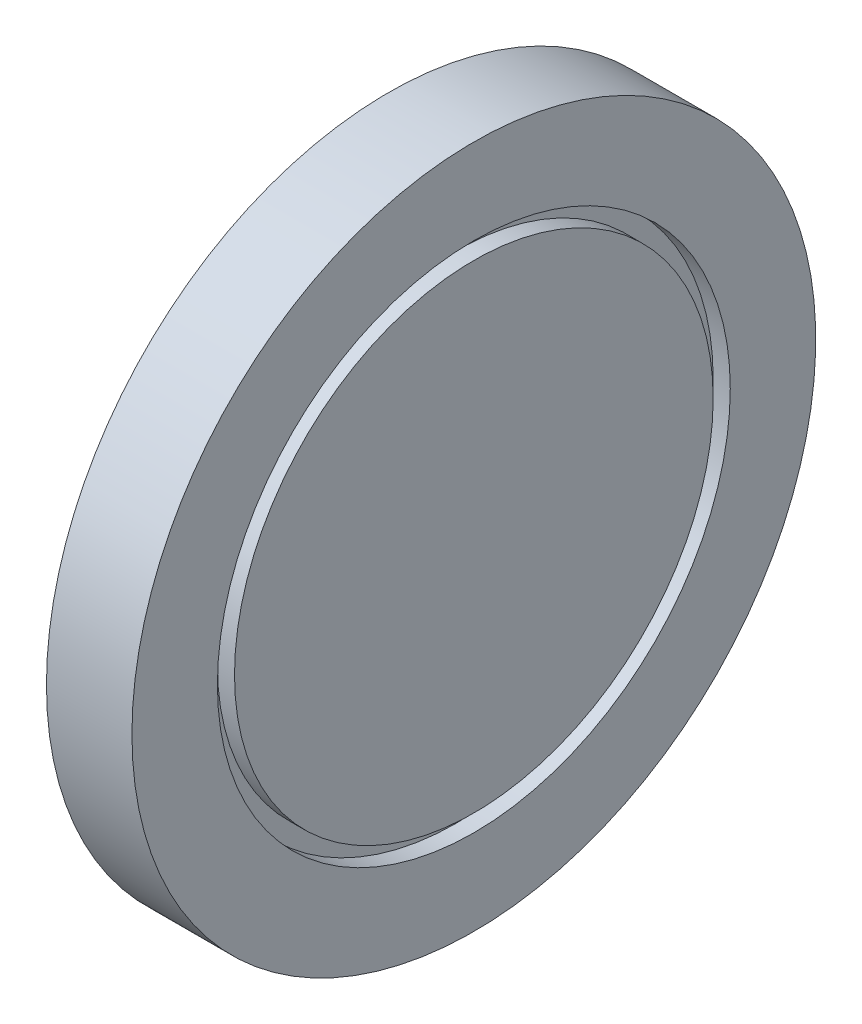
ISO-10303-21;
HEADER;
FILE_DESCRIPTION(('STEP AP214'),'2;1');
FILE_NAME('part.step','',(''),(''),'','','');
FILE_SCHEMA(('AUTOMOTIVE_DESIGN { 1 0 10303 214 1 1 1 1 }'));
ENDSEC;
DATA;
#1=APPLICATION_CONTEXT('core data for automotive mechanical design processes');
#2=APPLICATION_PROTOCOL_DEFINITION('international standard','automotive_design',2000,#1);
#3=PRODUCT_CONTEXT('',#1,'mechanical');
#4=PRODUCT('Part','Part','',(#3));
#5=PRODUCT_RELATED_PRODUCT_CATEGORY('part','',(#4));
#6=PRODUCT_DEFINITION_FORMATION('','',#4);
#7=PRODUCT_DEFINITION_CONTEXT('part definition',#1,'design');
#8=PRODUCT_DEFINITION('design','',#6,#7);
#9=PRODUCT_DEFINITION_SHAPE('','',#8);
#10=(LENGTH_UNIT() NAMED_UNIT(*) SI_UNIT(.MILLI.,.METRE.));
#11=(NAMED_UNIT(*) PLANE_ANGLE_UNIT() SI_UNIT($,.RADIAN.));
#12=(NAMED_UNIT(*) SI_UNIT($,.STERADIAN.) SOLID_ANGLE_UNIT());
#13=UNCERTAINTY_MEASURE_WITH_UNIT(LENGTH_MEASURE(1.E-05),#10,'distance_accuracy_value','');
#14=(GEOMETRIC_REPRESENTATION_CONTEXT(3) GLOBAL_UNCERTAINTY_ASSIGNED_CONTEXT((#13)) GLOBAL_UNIT_ASSIGNED_CONTEXT((#10,
#11,#12)) REPRESENTATION_CONTEXT('',''));
#15=CARTESIAN_POINT('',(0.,0.,0.));
#16=DIRECTION('',(0.,0.,1.));
#17=DIRECTION('',(1.,0.,0.));
#18=AXIS2_PLACEMENT_3D('',#15,#16,#17);
#19=CARTESIAN_POINT('',(0.,0.,0.));
#20=DIRECTION('',(1.,0.,0.));
#21=DIRECTION('',(0.,0.,-1.));
#22=AXIS2_PLACEMENT_3D('',#19,#20,#21);
#23=PLANE('',#22);
#24=CARTESIAN_POINT('',(0.,0.,0.));
#25=DIRECTION('',(-1.,0.,0.));
#26=DIRECTION('',(0.,0.,1.));
#27=AXIS2_PLACEMENT_3D('',#24,#25,#26);
#28=CIRCLE('',#27,100.);
#29=CARTESIAN_POINT('',(0.,0.,100.));
#30=VERTEX_POINT('',#29);
#31=EDGE_CURVE('E44',#30,#30,#28,.T.);
#32=ORIENTED_EDGE('',*,*,#31,.T.);
#33=EDGE_LOOP('',(#32));
#34=FACE_BOUND('',#33,.T.);
#35=CARTESIAN_POINT('',(0.,0.,0.));
#36=DIRECTION('',(1.,0.,0.));
#37=DIRECTION('',(0.,0.,-1.));
#38=AXIS2_PLACEMENT_3D('',#35,#36,#37);
#39=CIRCLE('',#38,3.5);
#40=CARTESIAN_POINT('',(0.,0.,-3.5));
#41=VERTEX_POINT('',#40);
#42=EDGE_CURVE('E10',#41,#41,#39,.F.);
#43=ORIENTED_EDGE('',*,*,#42,.F.);
#44=EDGE_LOOP('',(#43));
#45=FACE_BOUND('',#44,.T.);
#46=ADVANCED_FACE('F32',(#34,#45),#23,.F.);
#47=CARTESIAN_POINT('',(-63.8520449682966,0.,0.));
#48=DIRECTION('',(-1.,0.,0.));
#49=DIRECTION('',(0.,0.,1.));
#50=AXIS2_PLACEMENT_3D('',#47,#48,#49);
#51=CYLINDRICAL_SURFACE('',#50,100.);
#52=ORIENTED_EDGE('',*,*,#31,.F.);
#53=EDGE_LOOP('',(#52));
#54=FACE_BOUND('',#53,.T.);
#55=CARTESIAN_POINT('',(25.,0.,0.));
#56=DIRECTION('',(-1.,0.,0.));
#57=DIRECTION('',(0.,0.,1.));
#58=AXIS2_PLACEMENT_3D('',#55,#56,#57);
#59=CIRCLE('',#58,100.);
#60=CARTESIAN_POINT('',(25.,0.,100.));
#61=VERTEX_POINT('',#60);
#62=EDGE_CURVE('E49',#61,#61,#59,.T.);
#63=ORIENTED_EDGE('',*,*,#62,.T.);
#64=EDGE_LOOP('',(#63));
#65=FACE_BOUND('',#64,.T.);
#66=ADVANCED_FACE('F76',(#54,#65),#51,.T.);
#67=CARTESIAN_POINT('',(25.,0.,0.));
#68=DIRECTION('',(-1.,0.,0.));
#69=DIRECTION('',(0.,0.,1.));
#70=AXIS2_PLACEMENT_3D('',#67,#68,#69);
#71=PLANE('',#70);
#72=CARTESIAN_POINT('',(25.,0.,0.));
#73=DIRECTION('',(1.,0.,0.));
#74=DIRECTION('',(0.,0.,-1.));
#75=AXIS2_PLACEMENT_3D('',#72,#73,#74);
#76=CIRCLE('',#75,75.);
#77=CARTESIAN_POINT('',(25.,0.,-75.));
#78=VERTEX_POINT('',#77);
#79=EDGE_CURVE('E91',#78,#78,#76,.T.);
#80=ORIENTED_EDGE('',*,*,#79,.F.);
#81=EDGE_LOOP('',(#80));
#82=FACE_BOUND('',#81,.T.);
#83=ORIENTED_EDGE('',*,*,#62,.F.);
#84=EDGE_LOOP('',(#83));
#85=FACE_BOUND('',#84,.T.);
#86=ADVANCED_FACE('F81',(#82,#85),#71,.F.);
#87=CARTESIAN_POINT('',(20.,0.,0.));
#88=DIRECTION('',(1.,0.,0.));
#89=DIRECTION('',(0.,0.,-1.));
#90=AXIS2_PLACEMENT_3D('',#87,#88,#89);
#91=CYLINDRICAL_SURFACE('',#90,75.);
#92=CARTESIAN_POINT('',(20.,0.,0.));
#93=DIRECTION('',(1.,0.,0.));
#94=DIRECTION('',(0.,0.,-1.));
#95=AXIS2_PLACEMENT_3D('',#92,#93,#94);
#96=CIRCLE('',#95,75.);
#97=CARTESIAN_POINT('',(20.,0.,-75.));
#98=VERTEX_POINT('',#97);
#99=EDGE_CURVE('E89',#98,#98,#96,.T.);
#100=ORIENTED_EDGE('',*,*,#99,.F.);
#101=EDGE_LOOP('',(#100));
#102=FACE_BOUND('',#101,.T.);
#103=ORIENTED_EDGE('',*,*,#79,.T.);
#104=EDGE_LOOP('',(#103));
#105=FACE_BOUND('',#104,.T.);
#106=ADVANCED_FACE('F118',(#102,#105),#91,.F.);
#107=CARTESIAN_POINT('',(20.,0.,0.));
#108=DIRECTION('',(1.,0.,0.));
#109=DIRECTION('',(0.,0.,-1.));
#110=AXIS2_PLACEMENT_3D('',#107,#108,#109);
#111=PLANE('',#110);
#112=CARTESIAN_POINT('',(20.,0.,0.));
#113=DIRECTION('',(1.,0.,0.));
#114=DIRECTION('',(0.,0.,-1.));
#115=AXIS2_PLACEMENT_3D('',#112,#113,#114);
#116=CIRCLE('',#115,70.);
#117=CARTESIAN_POINT('',(20.,0.,-70.));
#118=VERTEX_POINT('',#117);
#119=EDGE_CURVE('E95',#118,#118,#116,.T.);
#120=ORIENTED_EDGE('',*,*,#119,.F.);
#121=EDGE_LOOP('',(#120));
#122=FACE_BOUND('',#121,.T.);
#123=ORIENTED_EDGE('',*,*,#99,.T.);
#124=EDGE_LOOP('',(#123));
#125=FACE_BOUND('',#124,.T.);
#126=ADVANCED_FACE('F115',(#122,#125),#111,.T.);
#127=CARTESIAN_POINT('',(20.,0.,0.));
#128=DIRECTION('',(1.,0.,0.));
#129=DIRECTION('',(0.,0.,-1.));
#130=AXIS2_PLACEMENT_3D('',#127,#128,#129);
#131=CYLINDRICAL_SURFACE('',#130,70.);
#132=ORIENTED_EDGE('',*,*,#119,.T.);
#133=EDGE_LOOP('',(#132));
#134=FACE_BOUND('',#133,.T.);
#135=CARTESIAN_POINT('',(25.,0.,0.));
#136=DIRECTION('',(1.,0.,0.));
#137=DIRECTION('',(0.,0.,-1.));
#138=AXIS2_PLACEMENT_3D('',#135,#136,#137);
#139=CIRCLE('',#138,70.);
#140=CARTESIAN_POINT('',(25.,0.,-70.));
#141=VERTEX_POINT('',#140);
#142=EDGE_CURVE('E97',#141,#141,#139,.T.);
#143=ORIENTED_EDGE('',*,*,#142,.F.);
#144=EDGE_LOOP('',(#143));
#145=FACE_BOUND('',#144,.T.);
#146=ADVANCED_FACE('F112',(#134,#145),#131,.T.);
#147=ORIENTED_EDGE('',*,*,#142,.T.);
#148=EDGE_LOOP('',(#147));
#149=FACE_BOUND('',#148,.T.);
#150=ADVANCED_FACE('F72',(#149),#71,.F.);
#151=CARTESIAN_POINT('',(-35.,0.,0.));
#152=DIRECTION('',(1.,0.,0.));
#153=DIRECTION('',(0.,0.,-1.));
#154=AXIS2_PLACEMENT_3D('',#151,#152,#153);
#155=CYLINDRICAL_SURFACE('',#154,3.5);
#156=CARTESIAN_POINT('',(-32.787154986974,0.,-3.5));
#157=CARTESIAN_POINT('',(-32.787145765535,-0.0801521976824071,-3.49999299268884));
#158=CARTESIAN_POINT('',(-32.7806928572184,-0.160419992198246,-3.4972151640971));
#159=CARTESIAN_POINT('',(-32.7551152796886,-0.318671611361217,-3.48637069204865));
#160=CARTESIAN_POINT('',(-32.7359586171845,-0.396649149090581,-3.47829069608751));
#161=CARTESIAN_POINT('',(-32.685819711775,-0.547768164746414,-3.45770786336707));
#162=CARTESIAN_POINT('',(-32.6548784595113,-0.620925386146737,-3.44522036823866));
#163=CARTESIAN_POINT('',(-32.5822228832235,-0.760936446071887,-3.41702837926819));
#164=CARTESIAN_POINT('',(-32.540511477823,-0.82779198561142,-3.40132475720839));
#165=CARTESIAN_POINT('',(-32.4451911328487,-0.956920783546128,-3.36733908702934));
#166=CARTESIAN_POINT('',(-32.3911073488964,-1.01882024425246,-3.34896947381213));
#167=CARTESIAN_POINT('',(-32.2735830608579,-1.1329951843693,-3.3120882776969));
#168=CARTESIAN_POINT('',(-32.2101373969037,-1.18526532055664,-3.29357662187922));
#169=CARTESIAN_POINT('',(-32.0716386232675,-1.28142843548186,-3.25741027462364));
#170=CARTESIAN_POINT('',(-31.9961497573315,-1.32473406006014,-3.23985230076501));
#171=CARTESIAN_POINT('',(-31.838100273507,-1.39786599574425,-3.2089808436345));
#172=CARTESIAN_POINT('',(-31.7555435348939,-1.42769964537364,-3.19566505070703));
#173=CARTESIAN_POINT('',(-31.5900046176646,-1.47147459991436,-3.17573899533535));
#174=CARTESIAN_POINT('',(-31.5072511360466,-1.48613747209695,-3.16882610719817));
#175=CARTESIAN_POINT('',(-31.3401920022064,-1.50140303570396,-3.16162424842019));
#176=CARTESIAN_POINT('',(-31.2558873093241,-1.50201414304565,-3.16133131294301));
#177=CARTESIAN_POINT('',(-31.0955050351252,-1.48969999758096,-3.16714786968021));
#178=CARTESIAN_POINT('',(-31.0193196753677,-1.47788056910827,-3.17273435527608));
#179=CARTESIAN_POINT('',(-30.870141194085,-1.44290386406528,-3.18879205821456));
#180=CARTESIAN_POINT('',(-30.7971487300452,-1.41974426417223,-3.19926427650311));
#181=CARTESIAN_POINT('',(-30.6545314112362,-1.36228829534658,-3.22415342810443));
#182=CARTESIAN_POINT('',(-30.5850148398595,-1.32775987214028,-3.23865147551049));
#183=CARTESIAN_POINT('',(-30.4524818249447,-1.24871152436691,-3.26994246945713));
#184=CARTESIAN_POINT('',(-30.3894680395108,-1.20418753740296,-3.28673634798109));
#185=CARTESIAN_POINT('',(-30.2657662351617,-1.10171702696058,-3.32256202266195));
#186=CARTESIAN_POINT('',(-30.2057966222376,-1.04292364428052,-3.34165927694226));
#187=CARTESIAN_POINT('',(-30.0963191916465,-0.915936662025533,-3.3786730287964));
#188=CARTESIAN_POINT('',(-30.046814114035,-0.847740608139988,-3.39658921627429));
#189=CARTESIAN_POINT('',(-29.9585330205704,-0.701592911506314,-3.4297984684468));
#190=CARTESIAN_POINT('',(-29.9200654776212,-0.623435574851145,-3.44501227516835));
#191=CARTESIAN_POINT('',(-29.8570798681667,-0.460939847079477,-3.47048698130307));
#192=CARTESIAN_POINT('',(-29.8325536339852,-0.376605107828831,-3.48075078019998));
#193=CARTESIAN_POINT('',(-29.7996880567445,-0.210138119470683,-3.49461763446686));
#194=CARTESIAN_POINT('',(-29.7903856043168,-0.128228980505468,-3.49861624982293));
#195=CARTESIAN_POINT('',(-29.7853401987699,0.0360716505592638,-3.50077708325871));
#196=CARTESIAN_POINT('',(-29.7895930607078,0.118462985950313,-3.49894110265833));
#197=CARTESIAN_POINT('',(-29.8108628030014,0.276771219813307,-3.48989338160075));
#198=CARTESIAN_POINT('',(-29.8271891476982,0.352799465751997,-3.48297259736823));
#199=CARTESIAN_POINT('',(-29.871165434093,0.500945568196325,-3.46476944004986));
#200=CARTESIAN_POINT('',(-29.8988167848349,0.573062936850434,-3.45348652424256));
#201=CARTESIAN_POINT('',(-29.9655555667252,0.713888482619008,-3.42719375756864));
#202=CARTESIAN_POINT('',(-30.0049731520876,0.782419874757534,-3.41207852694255));
#203=CARTESIAN_POINT('',(-30.0937644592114,0.912142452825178,-3.37971494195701));
#204=CARTESIAN_POINT('',(-30.1431424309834,0.973330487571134,-3.36246567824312));
#205=CARTESIAN_POINT('',(-30.2547997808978,1.09148379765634,-3.32607394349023));
#206=CARTESIAN_POINT('',(-30.3177710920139,1.14778308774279,-3.30688677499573));
#207=CARTESIAN_POINT('',(-30.4525461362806,1.24921715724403,-3.26992018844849));
#208=CARTESIAN_POINT('',(-30.524352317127,1.29434883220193,-3.25214116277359));
#209=CARTESIAN_POINT('',(-30.6765619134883,1.37281937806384,-3.21981484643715));
#210=CARTESIAN_POINT('',(-30.7570964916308,1.40593207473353,-3.20533127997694));
#211=CARTESIAN_POINT('',(-30.923418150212,1.45782942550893,-3.18206803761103));
#212=CARTESIAN_POINT('',(-31.0092004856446,1.47662682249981,-3.17328328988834));
#213=CARTESIAN_POINT('',(-31.1761505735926,1.49805974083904,-3.16321740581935));
#214=CARTESIAN_POINT('',(-31.2571346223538,1.50187346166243,-3.1613896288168));
#215=CARTESIAN_POINT('',(-31.4185498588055,1.49641325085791,-3.16397809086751));
#216=CARTESIAN_POINT('',(-31.4989811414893,1.48714162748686,-3.16839322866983));
#217=CARTESIAN_POINT('',(-31.6526758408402,1.45678214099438,-3.1824582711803));
#218=CARTESIAN_POINT('',(-31.7260944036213,1.4363348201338,-3.19182357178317));
#219=CARTESIAN_POINT('',(-31.8684653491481,1.38485117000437,-3.21449437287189));
#220=CARTESIAN_POINT('',(-31.9374164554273,1.35381183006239,-3.22780099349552));
#221=CARTESIAN_POINT('',(-32.0735654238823,1.27981602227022,-3.25787626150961));
#222=CARTESIAN_POINT('',(-32.1403898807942,1.23624027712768,-3.27480834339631));
#223=CARTESIAN_POINT('',(-32.2661458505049,1.13924888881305,-3.3097987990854));
#224=CARTESIAN_POINT('',(-32.325074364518,1.08582952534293,-3.32785759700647));
#225=CARTESIAN_POINT('',(-32.4381580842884,0.965671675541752,-3.36477750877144));
#226=CARTESIAN_POINT('',(-32.4915697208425,0.898214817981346,-3.38358948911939));
#227=CARTESIAN_POINT('',(-32.5863699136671,0.754612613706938,-3.41848089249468));
#228=CARTESIAN_POINT('',(-32.6277530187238,0.678463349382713,-3.43455907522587));
#229=CARTESIAN_POINT('',(-32.6964995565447,0.520626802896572,-3.46197513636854));
#230=CARTESIAN_POINT('',(-32.7240585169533,0.439036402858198,-3.47337868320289));
#231=CARTESIAN_POINT('',(-32.7647897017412,0.271925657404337,-3.49042295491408));
#232=CARTESIAN_POINT('',(-32.7780064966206,0.186418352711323,-3.49608152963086));
#233=CARTESIAN_POINT('',(-32.786035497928,0.0670267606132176,-3.49952115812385));
#234=CARTESIAN_POINT('',(-32.7871588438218,0.0335234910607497,-3.50000293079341));
#235=CARTESIAN_POINT('',(-32.787154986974,0.,-3.5));
#236=B_SPLINE_CURVE_WITH_KNOTS('',3,(#156,#157,#158,#159,#160,#161,#162,#163,#164,#165,#166,
#167,#168,#169,#170,#171,#172,#173,#174,#175,#176,#177,#178,#179,#180,#181,#182,#183,#184,#185,
#186,#187,#188,#189,#190,#191,#192,#193,#194,#195,#196,#197,#198,#199,#200,#201,#202,#203,#204,
#205,#206,#207,#208,#209,#210,#211,#212,#213,#214,#215,#216,#217,#218,#219,#220,#221,#222,#223,
#224,#225,#226,#227,#228,#229,#230,#231,#232,#233,#234,#235),.UNSPECIFIED.,.T.,.F.,(4,2,2,2,2,2,
2,2,2,2,2,2,2,2,2,2,2,2,2,2,2,2,2,2,2,2,2,2,2,2,2,2,2,2,2,2,2,2,2,4),(0.,0.240357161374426,
0.481321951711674,0.721456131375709,0.961525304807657,1.21311371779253,1.46484131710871,
1.72984780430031,1.99470976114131,2.2462971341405,2.49773382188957,2.72855360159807,
2.95942069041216,3.19532704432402,3.43132944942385,3.68854918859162,3.94583619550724,
4.20973622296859,4.47348148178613,4.71978673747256,4.96601595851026,5.19915597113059,
5.43232499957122,5.67277527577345,5.91332836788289,6.17201425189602,6.43077196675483,
6.69417345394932,6.9573401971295,7.19934244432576,7.44130200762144,7.67066022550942,
7.90008369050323,8.14372375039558,8.38745608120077,8.65042084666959,8.91350460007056,
9.17275427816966,9.43119596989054,9.5317248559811),.UNSPECIFIED.);
#237=CARTESIAN_POINT('',(-32.787154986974,0.,-3.5));
#238=VERTEX_POINT('',#237);
#239=EDGE_CURVE('E35',#238,#238,#236,.T.);
#240=ORIENTED_EDGE('',*,*,#239,.T.);
#241=EDGE_LOOP('',(#240));
#242=FACE_BOUND('',#241,.T.);
#243=CARTESIAN_POINT('',(-29.787154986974,0.,3.5));
#244=CARTESIAN_POINT('',(-29.787164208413,-0.0801521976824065,3.49999299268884));
#245=CARTESIAN_POINT('',(-29.7936171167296,-0.160419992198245,3.4972151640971));
#246=CARTESIAN_POINT('',(-29.8191946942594,-0.318671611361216,3.48637069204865));
#247=CARTESIAN_POINT('',(-29.8383513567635,-0.396649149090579,3.47829069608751));
#248=CARTESIAN_POINT('',(-29.888490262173,-0.547768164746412,3.45770786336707));
#249=CARTESIAN_POINT('',(-29.9194315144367,-0.620925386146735,3.44522036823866));
#250=CARTESIAN_POINT('',(-29.9920870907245,-0.760936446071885,3.41702837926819));
#251=CARTESIAN_POINT('',(-30.033798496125,-0.827791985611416,3.40132475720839));
#252=CARTESIAN_POINT('',(-30.1291188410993,-0.956920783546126,3.36733908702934));
#253=CARTESIAN_POINT('',(-30.1832026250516,-1.01882024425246,3.34896947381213));
#254=CARTESIAN_POINT('',(-30.3007269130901,-1.13299518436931,3.3120882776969));
#255=CARTESIAN_POINT('',(-30.3641725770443,-1.18526532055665,3.29357662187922));
#256=CARTESIAN_POINT('',(-30.5026713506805,-1.28142843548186,3.25741027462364));
#257=CARTESIAN_POINT('',(-30.5781602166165,-1.32473406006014,3.23985230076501));
#258=CARTESIAN_POINT('',(-30.736209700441,-1.39786599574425,3.2089808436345));
#259=CARTESIAN_POINT('',(-30.8187664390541,-1.42769964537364,3.19566505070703));
#260=CARTESIAN_POINT('',(-30.9843053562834,-1.47147459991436,3.17573899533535));
#261=CARTESIAN_POINT('',(-31.0670588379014,-1.48613747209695,3.16882610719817));
#262=CARTESIAN_POINT('',(-31.2341179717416,-1.50140303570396,3.16162424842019));
#263=CARTESIAN_POINT('',(-31.3184226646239,-1.50201414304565,3.16133131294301));
#264=CARTESIAN_POINT('',(-31.4788049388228,-1.48969999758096,3.16714786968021));
#265=CARTESIAN_POINT('',(-31.5549902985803,-1.47788056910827,3.17273435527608));
#266=CARTESIAN_POINT('',(-31.704168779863,-1.44290386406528,3.18879205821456));
#267=CARTESIAN_POINT('',(-31.7771612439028,-1.41974426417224,3.1992642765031));
#268=CARTESIAN_POINT('',(-31.9197785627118,-1.36228829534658,3.22415342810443));
#269=CARTESIAN_POINT('',(-31.9892951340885,-1.32775987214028,3.23865147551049));
#270=CARTESIAN_POINT('',(-32.1218281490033,-1.24871152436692,3.26994246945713));
#271=CARTESIAN_POINT('',(-32.1848419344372,-1.20418753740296,3.28673634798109));
#272=CARTESIAN_POINT('',(-32.3085437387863,-1.10171702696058,3.32256202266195));
#273=CARTESIAN_POINT('',(-32.3685133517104,-1.04292364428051,3.34165927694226));
#274=CARTESIAN_POINT('',(-32.4779907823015,-0.915936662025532,3.3786730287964));
#275=CARTESIAN_POINT('',(-32.527495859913,-0.847740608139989,3.39658921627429));
#276=CARTESIAN_POINT('',(-32.6157769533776,-0.701592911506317,3.4297984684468));
#277=CARTESIAN_POINT('',(-32.6542444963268,-0.623435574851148,3.44501227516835));
#278=CARTESIAN_POINT('',(-32.7172301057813,-0.460939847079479,3.47048698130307));
#279=CARTESIAN_POINT('',(-32.7417563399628,-0.376605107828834,3.48075078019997));
#280=CARTESIAN_POINT('',(-32.7746219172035,-0.210138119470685,3.49461763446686));
#281=CARTESIAN_POINT('',(-32.7839243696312,-0.128228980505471,3.49861624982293));
#282=CARTESIAN_POINT('',(-32.7889697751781,0.0360716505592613,3.50077708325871));
#283=CARTESIAN_POINT('',(-32.7847169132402,0.11846298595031,3.49894110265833));
#284=CARTESIAN_POINT('',(-32.7634471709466,0.276771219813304,3.48989338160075));
#285=CARTESIAN_POINT('',(-32.7471208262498,0.352799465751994,3.48297259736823));
#286=CARTESIAN_POINT('',(-32.703144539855,0.500945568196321,3.46476944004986));
#287=CARTESIAN_POINT('',(-32.6754931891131,0.573062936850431,3.45348652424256));
#288=CARTESIAN_POINT('',(-32.6087544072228,0.713888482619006,3.42719375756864));
#289=CARTESIAN_POINT('',(-32.5693368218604,0.782419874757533,3.41207852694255));
#290=CARTESIAN_POINT('',(-32.4805455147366,0.912142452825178,3.37971494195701));
#291=CARTESIAN_POINT('',(-32.4311675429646,0.973330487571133,3.36246567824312));
#292=CARTESIAN_POINT('',(-32.3195101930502,1.09148379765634,3.32607394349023));
#293=CARTESIAN_POINT('',(-32.2565388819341,1.14778308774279,3.30688677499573));
#294=CARTESIAN_POINT('',(-32.1217638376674,1.24921715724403,3.26992018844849));
#295=CARTESIAN_POINT('',(-32.049957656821,1.29434883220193,3.25214116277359));
#296=CARTESIAN_POINT('',(-31.8977480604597,1.37281937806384,3.21981484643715));
#297=CARTESIAN_POINT('',(-31.8172134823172,1.40593207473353,3.20533127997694));
#298=CARTESIAN_POINT('',(-31.650891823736,1.45782942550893,3.18206803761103));
#299=CARTESIAN_POINT('',(-31.5651094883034,1.47662682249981,3.17328328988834));
#300=CARTESIAN_POINT('',(-31.3981594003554,1.49805974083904,3.16321740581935));
#301=CARTESIAN_POINT('',(-31.3171753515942,1.50187346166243,3.1613896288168));
#302=CARTESIAN_POINT('',(-31.1557601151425,1.49641325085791,3.16397809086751));
#303=CARTESIAN_POINT('',(-31.0753288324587,1.48714162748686,3.16839322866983));
#304=CARTESIAN_POINT('',(-30.9216341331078,1.45678214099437,3.1824582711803));
#305=CARTESIAN_POINT('',(-30.8482155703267,1.43633482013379,3.19182357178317));
#306=CARTESIAN_POINT('',(-30.7058446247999,1.38485117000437,3.21449437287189));
#307=CARTESIAN_POINT('',(-30.6368935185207,1.35381183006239,3.22780099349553));
#308=CARTESIAN_POINT('',(-30.5007445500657,1.27981602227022,3.25787626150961));
#309=CARTESIAN_POINT('',(-30.4339200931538,1.23624027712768,3.2748083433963));
#310=CARTESIAN_POINT('',(-30.3081641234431,1.13924888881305,3.3097987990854));
#311=CARTESIAN_POINT('',(-30.24923560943,1.08582952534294,3.32785759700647));
#312=CARTESIAN_POINT('',(-30.1361518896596,0.965671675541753,3.36477750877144));
#313=CARTESIAN_POINT('',(-30.0827402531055,0.898214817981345,3.38358948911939));
#314=CARTESIAN_POINT('',(-29.9879400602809,0.754612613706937,3.41848089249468));
#315=CARTESIAN_POINT('',(-29.9465569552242,0.678463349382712,3.43455907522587));
#316=CARTESIAN_POINT('',(-29.8778104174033,0.520626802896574,3.46197513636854));
#317=CARTESIAN_POINT('',(-29.8502514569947,0.4390364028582,3.47337868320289));
#318=CARTESIAN_POINT('',(-29.8095202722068,0.27192565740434,3.49042295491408));
#319=CARTESIAN_POINT('',(-29.7963034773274,0.186418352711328,3.49608152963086));
#320=CARTESIAN_POINT('',(-29.78827447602,0.0670267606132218,3.49952115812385));
#321=CARTESIAN_POINT('',(-29.7871511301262,0.0335234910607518,3.50000293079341));
#322=CARTESIAN_POINT('',(-29.787154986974,0.,3.5));
#323=B_SPLINE_CURVE_WITH_KNOTS('',3,(#243,#244,#245,#246,#247,#248,#249,#250,#251,#252,#253,
#254,#255,#256,#257,#258,#259,#260,#261,#262,#263,#264,#265,#266,#267,#268,#269,#270,#271,#272,
#273,#274,#275,#276,#277,#278,#279,#280,#281,#282,#283,#284,#285,#286,#287,#288,#289,#290,#291,
#292,#293,#294,#295,#296,#297,#298,#299,#300,#301,#302,#303,#304,#305,#306,#307,#308,#309,#310,
#311,#312,#313,#314,#315,#316,#317,#318,#319,#320,#321,#322),.UNSPECIFIED.,.T.,.F.,(4,2,2,2,2,2,
2,2,2,2,2,2,2,2,2,2,2,2,2,2,2,2,2,2,2,2,2,2,2,2,2,2,2,2,2,2,2,2,2,4),(0.,0.240357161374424,
0.481321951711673,0.721456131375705,0.961525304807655,1.21311371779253,1.46484131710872,
1.72984780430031,1.99470976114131,2.2462971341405,2.49773382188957,2.72855360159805,
2.95942069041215,3.19532704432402,3.43132944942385,3.68854918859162,3.94583619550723,
4.20973622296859,4.47348148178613,4.71978673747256,4.96601595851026,5.19915597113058,
5.43232499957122,5.67277527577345,5.91332836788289,6.17201425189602,6.43077196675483,
6.69417345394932,6.95734019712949,7.19934244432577,7.44130200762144,7.67066022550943,
7.90008369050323,8.14372375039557,8.38745608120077,8.65042084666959,8.91350460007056,
9.17275427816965,9.43119596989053,9.53172485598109),.UNSPECIFIED.);
#324=CARTESIAN_POINT('',(-29.787154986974,0.,3.5));
#325=VERTEX_POINT('',#324);
#326=EDGE_CURVE('E52',#325,#325,#323,.T.);
#327=ORIENTED_EDGE('',*,*,#326,.T.);
#328=EDGE_LOOP('',(#327));
#329=FACE_BOUND('',#328,.T.);
#330=CARTESIAN_POINT('',(-35.,0.,0.));
#331=DIRECTION('',(-1.,0.,0.));
#332=DIRECTION('',(0.,0.,1.));
#333=AXIS2_PLACEMENT_3D('',#330,#331,#332);
#334=CIRCLE('',#333,3.5);
#335=CARTESIAN_POINT('',(-35.,0.,3.5));
#336=VERTEX_POINT('',#335);
#337=EDGE_CURVE('E100',#336,#336,#334,.T.);
#338=ORIENTED_EDGE('',*,*,#337,.F.);
#339=EDGE_LOOP('',(#338));
#340=FACE_BOUND('',#339,.T.);
#341=ORIENTED_EDGE('',*,*,#42,.T.);
#342=EDGE_LOOP('',(#341));
#343=FACE_BOUND('',#342,.T.);
#344=ADVANCED_FACE('F57',(#242,#329,#340,#343),#155,.T.);
#345=CARTESIAN_POINT('',(-35.,0.,0.));
#346=DIRECTION('',(-1.,0.,0.));
#347=DIRECTION('',(0.,0.,1.));
#348=AXIS2_PLACEMENT_3D('',#345,#346,#347);
#349=PLANE('',#348);
#350=ORIENTED_EDGE('',*,*,#337,.T.);
#351=EDGE_LOOP('',(#350));
#352=FACE_BOUND('',#351,.T.);
#353=ADVANCED_FACE('F64',(#352),#349,.T.);
#354=CARTESIAN_POINT('',(-31.287154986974,0.,-100.));
#355=DIRECTION('',(0.,0.,1.));
#356=DIRECTION('',(1.,0.,0.));
#357=AXIS2_PLACEMENT_3D('',#354,#355,#356);
#358=CYLINDRICAL_SURFACE('',#357,1.5);
#359=ORIENTED_EDGE('',*,*,#326,.F.);
#360=EDGE_LOOP('',(#359));
#361=FACE_BOUND('',#360,.T.);
#362=ORIENTED_EDGE('',*,*,#239,.F.);
#363=EDGE_LOOP('',(#362));
#364=FACE_BOUND('',#363,.T.);
#365=ADVANCED_FACE('F61',(#361,#364),#358,.F.);
#366=CLOSED_SHELL('',(#46,#66,#86,#106,#126,#146,#150,#344,#353,#365));
#367=MANIFOLD_SOLID_BREP('B2',#366);
#368=ADVANCED_BREP_SHAPE_REPRESENTATION('',(#18,#367),#14);
#369=SHAPE_DEFINITION_REPRESENTATION(#9,#368);
ENDSEC;
END-ISO-10303-21;
